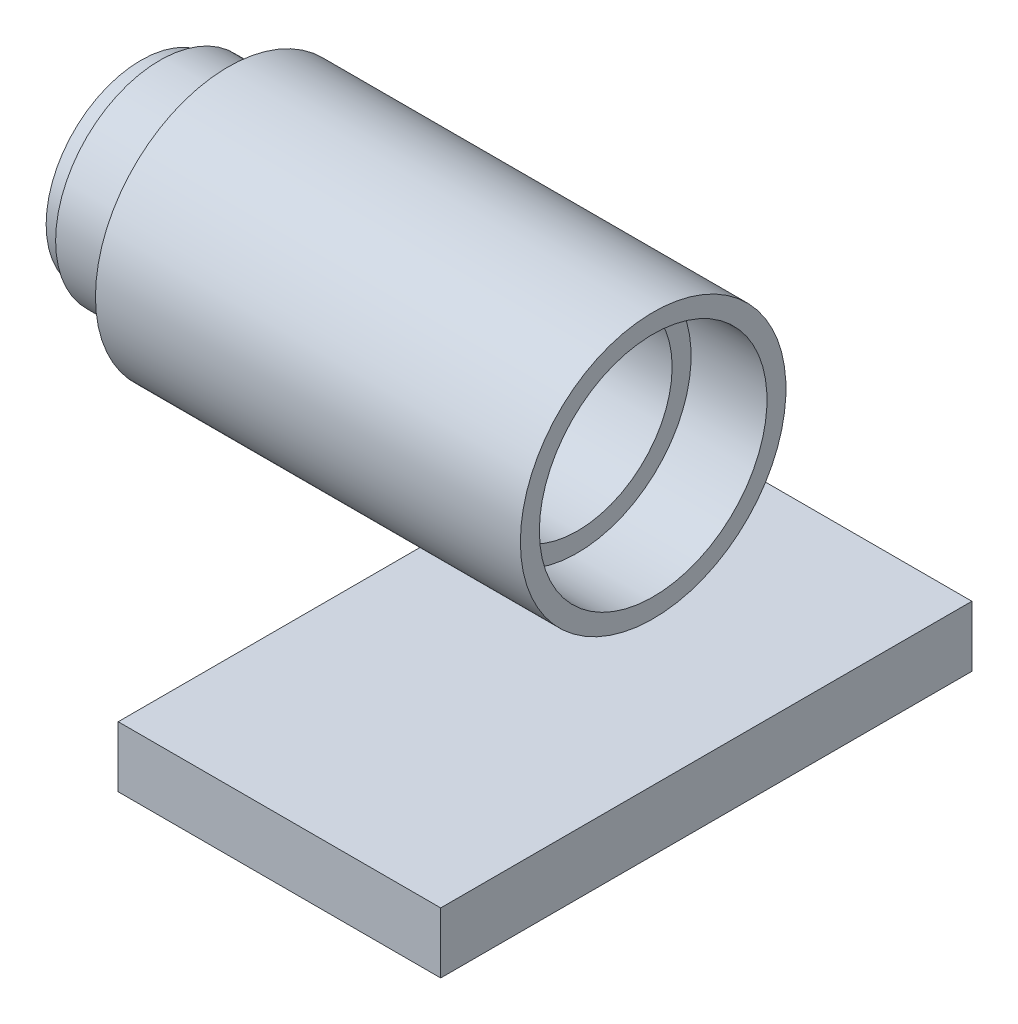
from build123d import *

# Parameters (mm, degrees)
SKETCH_1_W      = 85
SKETCH_1_H      = 16
EXTRUDE_2_DEPTH = 70


with BuildPart() as part:
    # Sketch 1 → Extrude 2 (new, symmetric)
    with BuildSketch(Plane.XY):
        with Locations((-42.5, 8)):
            Rectangle(SKETCH_1_W, SKETCH_1_H)
    extrude(amount=EXTRUDE_2_DEPTH, both=True)


with BuildPart() as body_2:
    # Sketch 2 → Revolve 2 (revolve)
    with BuildSketch(Plane.XY, mode=Mode.PRIVATE) as revolve_2_sk:
        Polygon((-149, 91), (-149, 100), (-144, 100), (-144, 102.5), (-126, 102.5), (-126, 110), (-14, 110), (-14, 105), (-34, 105), (-34, 100), (-114, 100), (-114, 91), align=None)
    revolve(revolve_2_sk.sketch.rotate(Axis((-107.067924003, 75, 0), (1, 0, 0)), 90), axis=Axis((-107.067924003, 75, 0), (1, 0, 0)))


solid = Compound([part.part, body_2.part])
